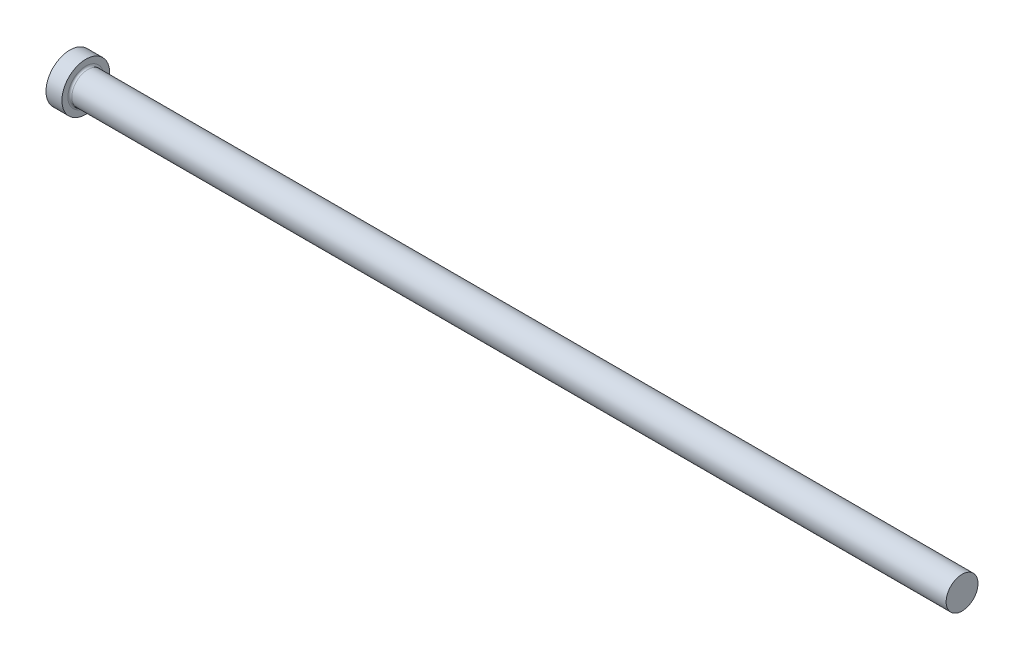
from build123d import *


with BuildPart() as part:
    # Sketch1 → PIN (revolve)
    with BuildSketch(Plane.XY, mode=Mode.PRIVATE) as pin_sk:
        with BuildLine():
            Line((0, 0), (0, 9.525))
            Line((0, 9.525), (6.35, 9.525))
            Line((6.35, 9.525), (6.35, 7.1374))
            ThreePointArc((6.35, 7.1374), (6.58062412, 6.58062412), (7.1374, 6.35))
            Line((7.1374, 6.35), (355.6, 6.35))
            Line((355.6, 6.35), (355.6, 0))
            Line((355.6, 0), (0, 0))
        make_face()
    revolve(pin_sk.sketch.rotate(Axis((355.6, 0, 0), (-1, 0, 0)), 180), axis=Axis((355.6, 0, 0), (-1, 0, 0)))


solid = part.part
